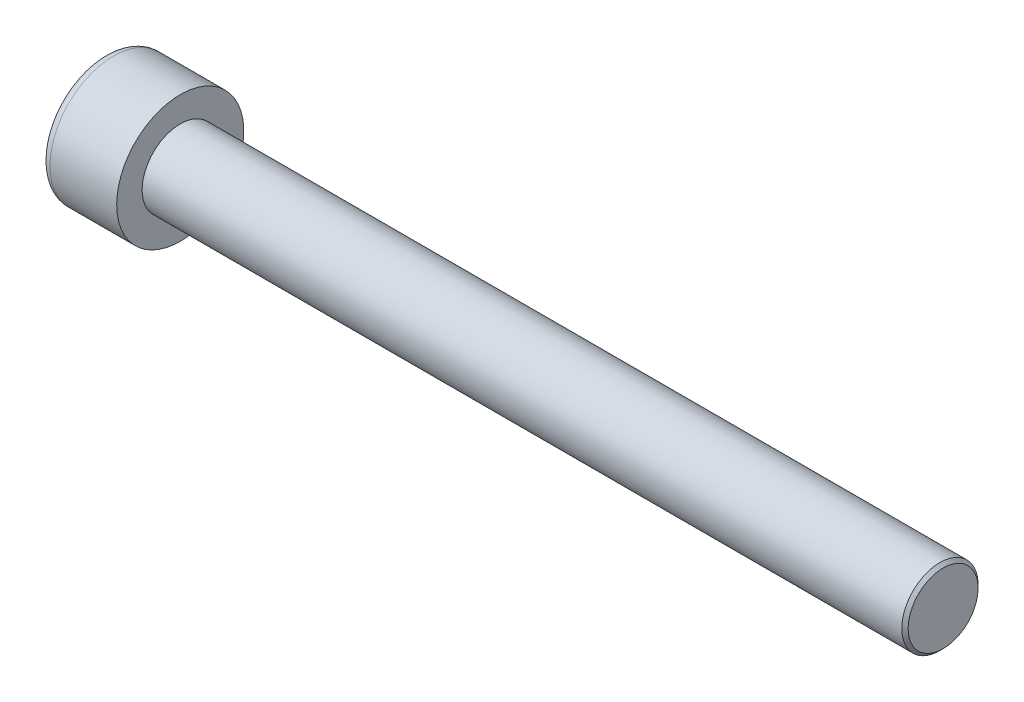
ISO-10303-21;
HEADER;
FILE_DESCRIPTION(('STEP AP214'),'2;1');
FILE_NAME('part.step','',(''),(''),'','','');
FILE_SCHEMA(('AUTOMOTIVE_DESIGN { 1 0 10303 214 1 1 1 1 }'));
ENDSEC;
DATA;
#1=APPLICATION_CONTEXT('core data for automotive mechanical design processes');
#2=APPLICATION_PROTOCOL_DEFINITION('international standard','automotive_design',2000,#1);
#3=PRODUCT_CONTEXT('',#1,'mechanical');
#4=PRODUCT('Part','Part','',(#3));
#5=PRODUCT_RELATED_PRODUCT_CATEGORY('part','',(#4));
#6=PRODUCT_DEFINITION_FORMATION('','',#4);
#7=PRODUCT_DEFINITION_CONTEXT('part definition',#1,'design');
#8=PRODUCT_DEFINITION('design','',#6,#7);
#9=PRODUCT_DEFINITION_SHAPE('','',#8);
#10=(LENGTH_UNIT() NAMED_UNIT(*) SI_UNIT(.MILLI.,.METRE.));
#11=(NAMED_UNIT(*) PLANE_ANGLE_UNIT() SI_UNIT($,.RADIAN.));
#12=(NAMED_UNIT(*) SI_UNIT($,.STERADIAN.) SOLID_ANGLE_UNIT());
#13=UNCERTAINTY_MEASURE_WITH_UNIT(LENGTH_MEASURE(1.E-05),#10,'distance_accuracy_value','');
#14=(GEOMETRIC_REPRESENTATION_CONTEXT(3) GLOBAL_UNCERTAINTY_ASSIGNED_CONTEXT((#13)) GLOBAL_UNIT_ASSIGNED_CONTEXT((#10,
#11,#12)) REPRESENTATION_CONTEXT('',''));
#15=CARTESIAN_POINT('',(0.,0.,0.));
#16=DIRECTION('',(0.,0.,1.));
#17=DIRECTION('',(1.,0.,0.));
#18=AXIS2_PLACEMENT_3D('',#15,#16,#17);
#19=CARTESIAN_POINT('',(3.,0.,-2.88675134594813));
#20=DIRECTION('',(1.,0.,0.));
#21=DIRECTION('',(0.,0.,-1.));
#22=AXIS2_PLACEMENT_3D('',#19,#20,#21);
#23=PLANE('',#22);
#24=DIRECTION('',(0.,0.,-1.));
#25=VECTOR('',#24,1.);
#26=CARTESIAN_POINT('',(3.,2.5,-2.88675134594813));
#27=LINE('',#26,#25);
#28=CARTESIAN_POINT('',(3.,2.5,-1.44337567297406));
#29=VERTEX_POINT('',#28);
#30=CARTESIAN_POINT('',(2.99999999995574,2.49999999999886,0.));
#31=VERTEX_POINT('',#30);
#32=EDGE_CURVE('E81',#29,#31,#27,.F.);
#33=ORIENTED_EDGE('',*,*,#32,.F.);
#34=DIRECTION('',(0.,0.866025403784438,0.5));
#35=VECTOR('',#34,1.);
#36=CARTESIAN_POINT('',(3.,1.25,-2.1650635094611));
#37=LINE('',#36,#35);
#38=CARTESIAN_POINT('',(2.99999999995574,1.24999999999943,-2.16506350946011));
#39=VERTEX_POINT('',#38);
#40=EDGE_CURVE('E104',#39,#29,#37,.T.);
#41=ORIENTED_EDGE('',*,*,#40,.F.);
#42=CARTESIAN_POINT('',(2.99999999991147,0.,0.));
#43=DIRECTION('',(-1.,0.,0.));
#44=DIRECTION('',(0.,-1.,0.));
#45=AXIS2_PLACEMENT_3D('',#42,#43,#44);
#46=CIRCLE('',#45,2.49999999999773);
#47=EDGE_CURVE('E112',#39,#31,#46,.F.);
#48=ORIENTED_EDGE('',*,*,#47,.T.);
#49=EDGE_LOOP('',(#33,#41,#48));
#50=FACE_BOUND('',#49,.T.);
#51=ADVANCED_FACE('F17',(#50),#23,.F.);
#52=CARTESIAN_POINT('',(3.,0.,-2.88675134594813));
#53=DIRECTION('',(1.,0.,0.));
#54=DIRECTION('',(0.,0.,-1.));
#55=AXIS2_PLACEMENT_3D('',#52,#53,#54);
#56=PLANE('',#55);
#57=DIRECTION('',(0.,-0.866025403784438,0.500000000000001));
#58=VECTOR('',#57,1.);
#59=CARTESIAN_POINT('',(3.,2.5,1.44337567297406));
#60=LINE('',#59,#58);
#61=CARTESIAN_POINT('',(3.,2.5,1.44337567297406));
#62=VERTEX_POINT('',#61);
#63=CARTESIAN_POINT('',(2.99999999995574,1.24999999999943,2.16506350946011));
#64=VERTEX_POINT('',#63);
#65=EDGE_CURVE('E279',#62,#64,#60,.T.);
#66=ORIENTED_EDGE('',*,*,#65,.F.);
#67=DIRECTION('',(0.,0.,-1.));
#68=VECTOR('',#67,1.);
#69=CARTESIAN_POINT('',(3.,2.5,-2.88675134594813));
#70=LINE('',#69,#68);
#71=EDGE_CURVE('E283',#31,#62,#70,.F.);
#72=ORIENTED_EDGE('',*,*,#71,.F.);
#73=CARTESIAN_POINT('',(2.99999999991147,0.,0.));
#74=DIRECTION('',(-1.,0.,0.));
#75=DIRECTION('',(0.,-1.,0.));
#76=AXIS2_PLACEMENT_3D('',#73,#74,#75);
#77=CIRCLE('',#76,2.49999999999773);
#78=EDGE_CURVE('E118',#31,#64,#77,.F.);
#79=ORIENTED_EDGE('',*,*,#78,.T.);
#80=EDGE_LOOP('',(#66,#72,#79));
#81=FACE_BOUND('',#80,.T.);
#82=ADVANCED_FACE('F324',(#81),#56,.F.);
#83=CARTESIAN_POINT('',(3.,0.,-2.88675134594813));
#84=DIRECTION('',(1.,0.,0.));
#85=DIRECTION('',(0.,0.,-1.));
#86=AXIS2_PLACEMENT_3D('',#83,#84,#85);
#87=PLANE('',#86);
#88=DIRECTION('',(0.,0.866025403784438,-0.500000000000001));
#89=VECTOR('',#88,1.);
#90=CARTESIAN_POINT('',(3.,-2.5,-1.44337567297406));
#91=LINE('',#90,#89);
#92=CARTESIAN_POINT('',(3.,-2.5,-1.44337567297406));
#93=VERTEX_POINT('',#92);
#94=CARTESIAN_POINT('',(2.99999999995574,-1.24999999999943,-2.16506350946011));
#95=VERTEX_POINT('',#94);
#96=EDGE_CURVE('E119',#93,#95,#91,.T.);
#97=ORIENTED_EDGE('',*,*,#96,.F.);
#98=DIRECTION('',(0.,0.,-1.));
#99=VECTOR('',#98,1.);
#100=CARTESIAN_POINT('',(3.,-2.5,-2.88675134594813));
#101=LINE('',#100,#99);
#102=CARTESIAN_POINT('',(2.99999999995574,-2.49999999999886,0.));
#103=VERTEX_POINT('',#102);
#104=EDGE_CURVE('E123',#103,#93,#101,.T.);
#105=ORIENTED_EDGE('',*,*,#104,.F.);
#106=CARTESIAN_POINT('',(2.99999999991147,0.,0.));
#107=DIRECTION('',(-1.,0.,0.));
#108=DIRECTION('',(0.,-1.,0.));
#109=AXIS2_PLACEMENT_3D('',#106,#107,#108);
#110=CIRCLE('',#109,2.49999999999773);
#111=EDGE_CURVE('E98',#103,#95,#110,.F.);
#112=ORIENTED_EDGE('',*,*,#111,.T.);
#113=EDGE_LOOP('',(#97,#105,#112));
#114=FACE_BOUND('',#113,.T.);
#115=ADVANCED_FACE('F336',(#114),#87,.F.);
#116=CARTESIAN_POINT('',(3.00000000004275,0.,0.));
#117=DIRECTION('',(-1.,0.,0.));
#118=DIRECTION('',(0.,-1.,0.));
#119=AXIS2_PLACEMENT_3D('',#116,#117,#118);
#120=CONICAL_SURFACE('',#119,2.49999999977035,1.04719755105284);
#121=CARTESIAN_POINT('',(4.44337567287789,0.,0.));
#122=VERTEX_POINT('',#121);
#123=VERTEX_LOOP('',#122);
#124=FACE_BOUND('',#123,.T.);
#125=ORIENTED_EDGE('',*,*,#47,.F.);
#126=CARTESIAN_POINT('',(2.99999999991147,0.,0.));
#127=DIRECTION('',(-1.,0.,0.));
#128=DIRECTION('',(0.,-1.,0.));
#129=AXIS2_PLACEMENT_3D('',#126,#127,#128);
#130=CIRCLE('',#129,2.49999999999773);
#131=EDGE_CURVE('E87',#95,#39,#130,.F.);
#132=ORIENTED_EDGE('',*,*,#131,.F.);
#133=ORIENTED_EDGE('',*,*,#111,.F.);
#134=CARTESIAN_POINT('',(2.99999999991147,0.,0.));
#135=DIRECTION('',(-1.,0.,0.));
#136=DIRECTION('',(0.,-1.,0.));
#137=AXIS2_PLACEMENT_3D('',#134,#135,#136);
#138=CIRCLE('',#137,2.49999999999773);
#139=CARTESIAN_POINT('',(2.99999999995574,-1.24999999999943,2.16506350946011));
#140=VERTEX_POINT('',#139);
#141=EDGE_CURVE('E97',#103,#140,#138,.T.);
#142=ORIENTED_EDGE('',*,*,#141,.T.);
#143=CARTESIAN_POINT('',(2.99999999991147,0.,0.));
#144=DIRECTION('',(-1.,0.,0.));
#145=DIRECTION('',(0.,-1.,0.));
#146=AXIS2_PLACEMENT_3D('',#143,#144,#145);
#147=CIRCLE('',#146,2.49999999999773);
#148=EDGE_CURVE('E121',#64,#140,#147,.F.);
#149=ORIENTED_EDGE('',*,*,#148,.F.);
#150=ORIENTED_EDGE('',*,*,#78,.F.);
#151=EDGE_LOOP('',(#125,#132,#133,#142,#149,#150));
#152=FACE_BOUND('',#151,.T.);
#153=ADVANCED_FACE('F116',(#124,#152),#120,.F.);
#154=CARTESIAN_POINT('',(3.,0.,-2.88675134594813));
#155=DIRECTION('',(1.,0.,0.));
#156=DIRECTION('',(0.,0.,-1.));
#157=AXIS2_PLACEMENT_3D('',#154,#155,#156);
#158=PLANE('',#157);
#159=DIRECTION('',(0.,0.,1.));
#160=VECTOR('',#159,1.);
#161=CARTESIAN_POINT('',(3.,-2.5,1.44337567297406));
#162=LINE('',#161,#160);
#163=CARTESIAN_POINT('',(3.,-2.5,1.44337567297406));
#164=VERTEX_POINT('',#163);
#165=EDGE_CURVE('E234',#164,#103,#162,.F.);
#166=ORIENTED_EDGE('',*,*,#165,.F.);
#167=DIRECTION('',(0.,0.866025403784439,0.5));
#168=VECTOR('',#167,1.);
#169=CARTESIAN_POINT('',(3.,0.,2.88675134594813));
#170=LINE('',#169,#168);
#171=EDGE_CURVE('E251',#140,#164,#170,.F.);
#172=ORIENTED_EDGE('',*,*,#171,.F.);
#173=ORIENTED_EDGE('',*,*,#141,.F.);
#174=EDGE_LOOP('',(#166,#172,#173));
#175=FACE_BOUND('',#174,.T.);
#176=ADVANCED_FACE('F252',(#175),#158,.F.);
#177=CARTESIAN_POINT('',(3.,0.,-2.88675134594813));
#178=DIRECTION('',(1.,0.,0.));
#179=DIRECTION('',(0.,0.,-1.));
#180=AXIS2_PLACEMENT_3D('',#177,#178,#179);
#181=PLANE('',#180);
#182=DIRECTION('',(0.,0.866025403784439,0.5));
#183=VECTOR('',#182,1.);
#184=CARTESIAN_POINT('',(3.,0.,2.88675134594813));
#185=LINE('',#184,#183);
#186=CARTESIAN_POINT('',(3.,0.,2.88675134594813));
#187=VERTEX_POINT('',#186);
#188=EDGE_CURVE('E241',#187,#140,#185,.F.);
#189=ORIENTED_EDGE('',*,*,#188,.F.);
#190=DIRECTION('',(0.,0.866025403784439,-0.5));
#191=VECTOR('',#190,1.);
#192=CARTESIAN_POINT('',(3.,2.5,1.44337567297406));
#193=LINE('',#192,#191);
#194=EDGE_CURVE('E244',#64,#187,#193,.F.);
#195=ORIENTED_EDGE('',*,*,#194,.F.);
#196=ORIENTED_EDGE('',*,*,#148,.T.);
#197=EDGE_LOOP('',(#189,#195,#196));
#198=FACE_BOUND('',#197,.T.);
#199=ADVANCED_FACE('F239',(#198),#181,.F.);
#200=CARTESIAN_POINT('',(3.,0.,-2.88675134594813));
#201=DIRECTION('',(1.,0.,0.));
#202=DIRECTION('',(0.,0.,-1.));
#203=AXIS2_PLACEMENT_3D('',#200,#201,#202);
#204=PLANE('',#203);
#205=DIRECTION('',(0.,-0.866025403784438,-0.5));
#206=VECTOR('',#205,1.);
#207=CARTESIAN_POINT('',(3.,0.,-2.88675134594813));
#208=LINE('',#207,#206);
#209=CARTESIAN_POINT('',(3.,0.,-2.88675134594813));
#210=VERTEX_POINT('',#209);
#211=EDGE_CURVE('E90',#210,#39,#208,.F.);
#212=ORIENTED_EDGE('',*,*,#211,.F.);
#213=DIRECTION('',(0.,-0.866025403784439,0.5));
#214=VECTOR('',#213,1.);
#215=CARTESIAN_POINT('',(3.,-2.5,-1.44337567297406));
#216=LINE('',#215,#214);
#217=EDGE_CURVE('E93',#95,#210,#216,.F.);
#218=ORIENTED_EDGE('',*,*,#217,.F.);
#219=ORIENTED_EDGE('',*,*,#131,.T.);
#220=EDGE_LOOP('',(#212,#218,#219));
#221=FACE_BOUND('',#220,.T.);
#222=ADVANCED_FACE('F89',(#221),#204,.F.);
#223=CARTESIAN_POINT('',(3.,-2.5,1.44337567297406));
#224=DIRECTION('',(0.,1.,0.));
#225=DIRECTION('',(0.,0.,1.));
#226=AXIS2_PLACEMENT_3D('',#223,#224,#225);
#227=PLANE('',#226);
#228=ORIENTED_EDGE('',*,*,#104,.T.);
#229=DIRECTION('',(1.,0.,0.));
#230=VECTOR('',#229,1.);
#231=CARTESIAN_POINT('',(3.,-2.5,-1.44337567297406));
#232=LINE('',#231,#230);
#233=CARTESIAN_POINT('',(0.,-2.5,-1.44337567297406));
#234=VERTEX_POINT('',#233);
#235=EDGE_CURVE('E294',#234,#93,#232,.T.);
#236=ORIENTED_EDGE('',*,*,#235,.F.);
#237=DIRECTION('',(0.,0.,-1.));
#238=VECTOR('',#237,1.);
#239=CARTESIAN_POINT('',(0.,-2.5,0.));
#240=LINE('',#239,#238);
#241=CARTESIAN_POINT('',(0.,-2.5,1.44337567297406));
#242=VERTEX_POINT('',#241);
#243=EDGE_CURVE('E154',#234,#242,#240,.F.);
#244=ORIENTED_EDGE('',*,*,#243,.T.);
#245=DIRECTION('',(1.,0.,0.));
#246=VECTOR('',#245,1.);
#247=CARTESIAN_POINT('',(3.,-2.5,1.44337567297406));
#248=LINE('',#247,#246);
#249=EDGE_CURVE('E256',#164,#242,#248,.F.);
#250=ORIENTED_EDGE('',*,*,#249,.F.);
#251=ORIENTED_EDGE('',*,*,#165,.T.);
#252=EDGE_LOOP('',(#228,#236,#244,#250,#251));
#253=FACE_BOUND('',#252,.T.);
#254=ADVANCED_FACE('F317',(#253),#227,.T.);
#255=CARTESIAN_POINT('',(3.,0.,2.88675134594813));
#256=DIRECTION('',(0.,0.5,-0.866025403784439));
#257=DIRECTION('',(0.,0.866025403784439,0.5));
#258=AXIS2_PLACEMENT_3D('',#255,#256,#257);
#259=PLANE('',#258);
#260=ORIENTED_EDGE('',*,*,#171,.T.);
#261=ORIENTED_EDGE('',*,*,#249,.T.);
#262=DIRECTION('',(0.,0.866025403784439,0.5));
#263=VECTOR('',#262,1.);
#264=CARTESIAN_POINT('',(0.,-2.5,1.44337567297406));
#265=LINE('',#264,#263);
#266=CARTESIAN_POINT('',(0.,0.,2.88675134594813));
#267=VERTEX_POINT('',#266);
#268=EDGE_CURVE('E151',#242,#267,#265,.T.);
#269=ORIENTED_EDGE('',*,*,#268,.T.);
#270=DIRECTION('',(1.,0.,0.));
#271=VECTOR('',#270,1.);
#272=CARTESIAN_POINT('',(3.,0.,2.88675134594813));
#273=LINE('',#272,#271);
#274=EDGE_CURVE('E260',#187,#267,#273,.F.);
#275=ORIENTED_EDGE('',*,*,#274,.F.);
#276=ORIENTED_EDGE('',*,*,#188,.T.);
#277=EDGE_LOOP('',(#260,#261,#269,#275,#276));
#278=FACE_BOUND('',#277,.T.);
#279=ADVANCED_FACE('F258',(#278),#259,.T.);
#280=CARTESIAN_POINT('',(3.,2.5,1.44337567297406));
#281=DIRECTION('',(0.,-0.5,-0.866025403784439));
#282=DIRECTION('',(0.,0.866025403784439,-0.5));
#283=AXIS2_PLACEMENT_3D('',#280,#281,#282);
#284=PLANE('',#283);
#285=ORIENTED_EDGE('',*,*,#194,.T.);
#286=ORIENTED_EDGE('',*,*,#274,.T.);
#287=DIRECTION('',(0.,0.866025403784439,-0.5));
#288=VECTOR('',#287,1.);
#289=CARTESIAN_POINT('',(0.,0.,2.88675134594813));
#290=LINE('',#289,#288);
#291=CARTESIAN_POINT('',(0.,2.5,1.44337567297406));
#292=VERTEX_POINT('',#291);
#293=EDGE_CURVE('E148',#267,#292,#290,.T.);
#294=ORIENTED_EDGE('',*,*,#293,.T.);
#295=DIRECTION('',(1.,0.,0.));
#296=VECTOR('',#295,1.);
#297=CARTESIAN_POINT('',(3.,2.5,1.44337567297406));
#298=LINE('',#297,#296);
#299=EDGE_CURVE('E109',#62,#292,#298,.F.);
#300=ORIENTED_EDGE('',*,*,#299,.F.);
#301=ORIENTED_EDGE('',*,*,#65,.T.);
#302=EDGE_LOOP('',(#285,#286,#294,#300,#301));
#303=FACE_BOUND('',#302,.T.);
#304=ADVANCED_FACE('F320',(#303),#284,.T.);
#305=CARTESIAN_POINT('',(3.,2.5,-1.44337567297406));
#306=DIRECTION('',(0.,-1.,0.));
#307=DIRECTION('',(0.,0.,-1.));
#308=AXIS2_PLACEMENT_3D('',#305,#306,#307);
#309=PLANE('',#308);
#310=ORIENTED_EDGE('',*,*,#71,.T.);
#311=ORIENTED_EDGE('',*,*,#299,.T.);
#312=DIRECTION('',(0.,0.,-1.));
#313=VECTOR('',#312,1.);
#314=CARTESIAN_POINT('',(0.,2.5,0.));
#315=LINE('',#314,#313);
#316=CARTESIAN_POINT('',(0.,2.5,-1.44337567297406));
#317=VERTEX_POINT('',#316);
#318=EDGE_CURVE('E139',#292,#317,#315,.T.);
#319=ORIENTED_EDGE('',*,*,#318,.T.);
#320=DIRECTION('',(1.,0.,0.));
#321=VECTOR('',#320,1.);
#322=CARTESIAN_POINT('',(3.,2.5,-1.44337567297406));
#323=LINE('',#322,#321);
#324=EDGE_CURVE('E108',#29,#317,#323,.F.);
#325=ORIENTED_EDGE('',*,*,#324,.F.);
#326=ORIENTED_EDGE('',*,*,#32,.T.);
#327=EDGE_LOOP('',(#310,#311,#319,#325,#326));
#328=FACE_BOUND('',#327,.T.);
#329=ADVANCED_FACE('F322',(#328),#309,.T.);
#330=CARTESIAN_POINT('',(3.,0.,-2.88675134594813));
#331=DIRECTION('',(0.,-0.5,0.866025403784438));
#332=DIRECTION('',(0.,-0.866025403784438,-0.5));
#333=AXIS2_PLACEMENT_3D('',#330,#331,#332);
#334=PLANE('',#333);
#335=ORIENTED_EDGE('',*,*,#40,.T.);
#336=ORIENTED_EDGE('',*,*,#324,.T.);
#337=DIRECTION('',(0.,-0.866025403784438,-0.5));
#338=VECTOR('',#337,1.);
#339=CARTESIAN_POINT('',(0.,2.5,-1.44337567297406));
#340=LINE('',#339,#338);
#341=CARTESIAN_POINT('',(0.,0.,-2.88675134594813));
#342=VERTEX_POINT('',#341);
#343=EDGE_CURVE('E133',#317,#342,#340,.T.);
#344=ORIENTED_EDGE('',*,*,#343,.T.);
#345=DIRECTION('',(1.,0.,0.));
#346=VECTOR('',#345,1.);
#347=CARTESIAN_POINT('',(3.,0.,-2.88675134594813));
#348=LINE('',#347,#346);
#349=EDGE_CURVE('E107',#210,#342,#348,.F.);
#350=ORIENTED_EDGE('',*,*,#349,.F.);
#351=ORIENTED_EDGE('',*,*,#211,.T.);
#352=EDGE_LOOP('',(#335,#336,#344,#350,#351));
#353=FACE_BOUND('',#352,.T.);
#354=ADVANCED_FACE('F102',(#353),#334,.T.);
#355=CARTESIAN_POINT('',(3.,-2.5,-1.44337567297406));
#356=DIRECTION('',(0.,0.5,0.866025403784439));
#357=DIRECTION('',(0.,-0.866025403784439,0.5));
#358=AXIS2_PLACEMENT_3D('',#355,#356,#357);
#359=PLANE('',#358);
#360=ORIENTED_EDGE('',*,*,#217,.T.);
#361=ORIENTED_EDGE('',*,*,#349,.T.);
#362=DIRECTION('',(0.,-0.866025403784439,0.5));
#363=VECTOR('',#362,1.);
#364=CARTESIAN_POINT('',(0.,0.,-2.88675134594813));
#365=LINE('',#364,#363);
#366=EDGE_CURVE('E130',#342,#234,#365,.T.);
#367=ORIENTED_EDGE('',*,*,#366,.T.);
#368=ORIENTED_EDGE('',*,*,#235,.T.);
#369=ORIENTED_EDGE('',*,*,#96,.T.);
#370=EDGE_LOOP('',(#360,#361,#367,#368,#369));
#371=FACE_BOUND('',#370,.T.);
#372=ADVANCED_FACE('F190',(#371),#359,.T.);
#373=CARTESIAN_POINT('',(0.,0.,0.));
#374=DIRECTION('',(1.,0.,0.));
#375=DIRECTION('',(0.,0.,-1.));
#376=AXIS2_PLACEMENT_3D('',#373,#374,#375);
#377=PLANE('',#376);
#378=ORIENTED_EDGE('',*,*,#343,.F.);
#379=ORIENTED_EDGE('',*,*,#318,.F.);
#380=ORIENTED_EDGE('',*,*,#293,.F.);
#381=ORIENTED_EDGE('',*,*,#268,.F.);
#382=ORIENTED_EDGE('',*,*,#243,.F.);
#383=ORIENTED_EDGE('',*,*,#366,.F.);
#384=EDGE_LOOP('',(#378,#379,#380,#381,#382,#383));
#385=FACE_BOUND('',#384,.T.);
#386=CARTESIAN_POINT('',(0.,0.,0.));
#387=DIRECTION('',(1.,0.,0.));
#388=DIRECTION('',(0.,0.,-1.));
#389=AXIS2_PLACEMENT_3D('',#386,#387,#388);
#390=CIRCLE('',#389,4.25);
#391=CARTESIAN_POINT('',(0.,0.,-4.25));
#392=VERTEX_POINT('',#391);
#393=CARTESIAN_POINT('',(0.,0.,4.25));
#394=VERTEX_POINT('',#393);
#395=EDGE_CURVE('E128',#392,#394,#390,.T.);
#396=ORIENTED_EDGE('',*,*,#395,.F.);
#397=CARTESIAN_POINT('',(0.,0.,0.));
#398=DIRECTION('',(1.,0.,0.));
#399=DIRECTION('',(0.,0.,1.));
#400=AXIS2_PLACEMENT_3D('',#397,#398,#399);
#401=CIRCLE('',#400,4.25);
#402=EDGE_CURVE('E36',#394,#392,#401,.T.);
#403=ORIENTED_EDGE('',*,*,#402,.F.);
#404=EDGE_LOOP('',(#396,#403));
#405=FACE_BOUND('',#404,.T.);
#406=ADVANCED_FACE('F171',(#385,#405),#377,.F.);
#407=CARTESIAN_POINT('',(0.75,0.,0.));
#408=DIRECTION('',(1.,0.,0.));
#409=DIRECTION('',(0.,0.,-1.));
#410=AXIS2_PLACEMENT_3D('',#407,#408,#409);
#411=TOROIDAL_SURFACE('',#410,4.25,0.75);
#412=CARTESIAN_POINT('',(0.75,0.,0.));
#413=DIRECTION('',(-1.,0.,0.));
#414=DIRECTION('',(0.,0.,1.));
#415=AXIS2_PLACEMENT_3D('',#412,#413,#414);
#416=CIRCLE('',#415,5.);
#417=CARTESIAN_POINT('',(0.75,0.,5.));
#418=VERTEX_POINT('',#417);
#419=EDGE_CURVE('E131',#418,#418,#416,.F.);
#420=ORIENTED_EDGE('',*,*,#419,.F.);
#421=EDGE_LOOP('',(#420));
#422=FACE_BOUND('',#421,.T.);
#423=ORIENTED_EDGE('',*,*,#395,.T.);
#424=ORIENTED_EDGE('',*,*,#402,.T.);
#425=EDGE_LOOP('',(#423,#424));
#426=FACE_BOUND('',#425,.T.);
#427=ADVANCED_FACE('F127',(#422,#426),#411,.T.);
#428=CARTESIAN_POINT('',(66.,0.,0.));
#429=DIRECTION('',(1.,0.,0.));
#430=DIRECTION('',(0.,0.,-1.));
#431=AXIS2_PLACEMENT_3D('',#428,#429,#430);
#432=PLANE('',#431);
#433=CARTESIAN_POINT('',(65.9999999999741,0.,0.));
#434=DIRECTION('',(-1.,0.,0.));
#435=DIRECTION('',(0.,0.,1.));
#436=AXIS2_PLACEMENT_3D('',#433,#434,#435);
#437=CIRCLE('',#436,2.74999999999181);
#438=CARTESIAN_POINT('',(65.9999999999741,0.,2.74999999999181));
#439=VERTEX_POINT('',#438);
#440=EDGE_CURVE('E226',#439,#439,#437,.T.);
#441=ORIENTED_EDGE('',*,*,#440,.F.);
#442=EDGE_LOOP('',(#441));
#443=FACE_BOUND('',#442,.T.);
#444=ADVANCED_FACE('F170',(#443),#432,.T.);
#445=CARTESIAN_POINT('',(6.,0.,0.));
#446=DIRECTION('',(-1.,0.,0.));
#447=DIRECTION('',(0.,0.,1.));
#448=AXIS2_PLACEMENT_3D('',#445,#446,#447);
#449=CYLINDRICAL_SURFACE('',#448,5.);
#450=ORIENTED_EDGE('',*,*,#419,.T.);
#451=EDGE_LOOP('',(#450));
#452=FACE_BOUND('',#451,.T.);
#453=CARTESIAN_POINT('',(6.,0.,0.));
#454=DIRECTION('',(-1.,0.,0.));
#455=DIRECTION('',(0.,0.,1.));
#456=AXIS2_PLACEMENT_3D('',#453,#454,#455);
#457=CIRCLE('',#456,5.);
#458=CARTESIAN_POINT('',(6.,0.,5.));
#459=VERTEX_POINT('',#458);
#460=EDGE_CURVE('E224',#459,#459,#457,.F.);
#461=ORIENTED_EDGE('',*,*,#460,.F.);
#462=EDGE_LOOP('',(#461));
#463=FACE_BOUND('',#462,.T.);
#464=ADVANCED_FACE('F211',(#452,#463),#449,.T.);
#465=CARTESIAN_POINT('',(65.7499999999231,0.,0.));
#466=DIRECTION('',(-1.,0.,0.));
#467=DIRECTION('',(0.,0.,1.));
#468=AXIS2_PLACEMENT_3D('',#465,#466,#467);
#469=CONICAL_SURFACE('',#468,2.9999999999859,0.785398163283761);
#470=CARTESIAN_POINT('',(65.75,0.,0.));
#471=DIRECTION('',(-1.,0.,0.));
#472=DIRECTION('',(0.,0.,1.));
#473=AXIS2_PLACEMENT_3D('',#470,#471,#472);
#474=CIRCLE('',#473,3.);
#475=CARTESIAN_POINT('',(65.75,0.,3.));
#476=VERTEX_POINT('',#475);
#477=EDGE_CURVE('E28',#476,#476,#474,.T.);
#478=ORIENTED_EDGE('',*,*,#477,.F.);
#479=EDGE_LOOP('',(#478));
#480=FACE_BOUND('',#479,.T.);
#481=ORIENTED_EDGE('',*,*,#440,.T.);
#482=EDGE_LOOP('',(#481));
#483=FACE_BOUND('',#482,.T.);
#484=ADVANCED_FACE('F205',(#480,#483),#469,.T.);
#485=CARTESIAN_POINT('',(6.,0.,0.));
#486=DIRECTION('',(1.,0.,0.));
#487=DIRECTION('',(0.,0.,-1.));
#488=AXIS2_PLACEMENT_3D('',#485,#486,#487);
#489=PLANE('',#488);
#490=CARTESIAN_POINT('',(6.,0.,0.));
#491=DIRECTION('',(-1.,0.,0.));
#492=DIRECTION('',(0.,0.,1.));
#493=AXIS2_PLACEMENT_3D('',#490,#491,#492);
#494=CIRCLE('',#493,3.);
#495=CARTESIAN_POINT('',(6.,0.,3.));
#496=VERTEX_POINT('',#495);
#497=EDGE_CURVE('E11',#496,#496,#494,.F.);
#498=ORIENTED_EDGE('',*,*,#497,.F.);
#499=EDGE_LOOP('',(#498));
#500=FACE_BOUND('',#499,.T.);
#501=ORIENTED_EDGE('',*,*,#460,.T.);
#502=EDGE_LOOP('',(#501));
#503=FACE_BOUND('',#502,.T.);
#504=ADVANCED_FACE('F199',(#500,#503),#489,.T.);
#505=CARTESIAN_POINT('',(66.,0.,0.));
#506=DIRECTION('',(-1.,0.,0.));
#507=DIRECTION('',(0.,0.,1.));
#508=AXIS2_PLACEMENT_3D('',#505,#506,#507);
#509=CYLINDRICAL_SURFACE('',#508,3.);
#510=ORIENTED_EDGE('',*,*,#497,.T.);
#511=EDGE_LOOP('',(#510));
#512=FACE_BOUND('',#511,.T.);
#513=ORIENTED_EDGE('',*,*,#477,.T.);
#514=EDGE_LOOP('',(#513));
#515=FACE_BOUND('',#514,.T.);
#516=ADVANCED_FACE('F197',(#512,#515),#509,.T.);
#517=CLOSED_SHELL('',(#51,#82,#115,#153,#176,#199,#222,#254,#279,#304,#329,#354,#372,#406,#427,
#444,#464,#484,#504,#516));
#518=MANIFOLD_SOLID_BREP('B1',#517);
#519=ADVANCED_BREP_SHAPE_REPRESENTATION('',(#18,#518),#14);
#520=SHAPE_DEFINITION_REPRESENTATION(#9,#519);
ENDSEC;
END-ISO-10303-21;
